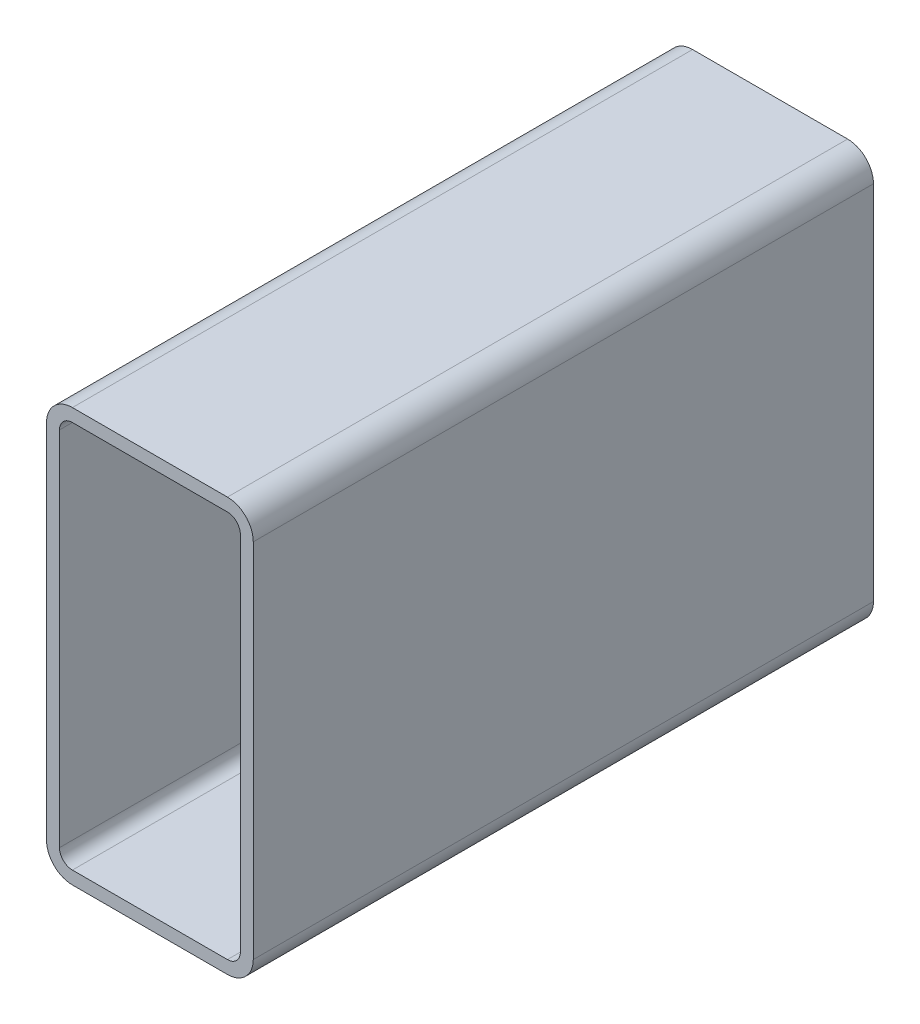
ISO-10303-21;
HEADER;
FILE_DESCRIPTION(('STEP AP214'),'2;1');
FILE_NAME('part.step','',(''),(''),'','','');
FILE_SCHEMA(('AUTOMOTIVE_DESIGN { 1 0 10303 214 1 1 1 1 }'));
ENDSEC;
DATA;
#1=APPLICATION_CONTEXT('core data for automotive mechanical design processes');
#2=APPLICATION_PROTOCOL_DEFINITION('international standard','automotive_design',2000,#1);
#3=PRODUCT_CONTEXT('',#1,'mechanical');
#4=PRODUCT('Part','Part','',(#3));
#5=PRODUCT_RELATED_PRODUCT_CATEGORY('part','',(#4));
#6=PRODUCT_DEFINITION_FORMATION('','',#4);
#7=PRODUCT_DEFINITION_CONTEXT('part definition',#1,'design');
#8=PRODUCT_DEFINITION('design','',#6,#7);
#9=PRODUCT_DEFINITION_SHAPE('','',#8);
#10=(LENGTH_UNIT() NAMED_UNIT(*) SI_UNIT(.MILLI.,.METRE.));
#11=(NAMED_UNIT(*) PLANE_ANGLE_UNIT() SI_UNIT($,.RADIAN.));
#12=(NAMED_UNIT(*) SI_UNIT($,.STERADIAN.) SOLID_ANGLE_UNIT());
#13=UNCERTAINTY_MEASURE_WITH_UNIT(LENGTH_MEASURE(1.E-05),#10,'distance_accuracy_value','');
#14=(GEOMETRIC_REPRESENTATION_CONTEXT(3) GLOBAL_UNCERTAINTY_ASSIGNED_CONTEXT((#13)) GLOBAL_UNIT_ASSIGNED_CONTEXT((#10,
#11,#12)) REPRESENTATION_CONTEXT('',''));
#15=CARTESIAN_POINT('',(0.,0.,0.));
#16=DIRECTION('',(0.,0.,1.));
#17=DIRECTION('',(1.,0.,0.));
#18=AXIS2_PLACEMENT_3D('',#15,#16,#17);
#19=CARTESIAN_POINT('',(14.3751778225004,192.466130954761,304.8));
#20=DIRECTION('',(0.,0.,1.));
#21=DIRECTION('',(1.,0.,0.));
#22=AXIS2_PLACEMENT_3D('',#19,#20,#21);
#23=PLANE('',#22);
#24=CARTESIAN_POINT('',(14.3751778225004,192.466130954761,304.8));
#25=DIRECTION('',(0.,0.,1.));
#26=DIRECTION('',(1.,0.,0.));
#27=AXIS2_PLACEMENT_3D('',#24,#25,#26);
#28=CIRCLE('',#27,12.7);
#29=CARTESIAN_POINT('',(14.3751778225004,205.166130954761,304.8));
#30=VERTEX_POINT('',#29);
#31=CARTESIAN_POINT('',(1.67517782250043,192.466130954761,304.8));
#32=VERTEX_POINT('',#31);
#33=EDGE_CURVE('E211',#30,#32,#28,.T.);
#34=ORIENTED_EDGE('',*,*,#33,.T.);
#35=DIRECTION('',(0.,-1.,0.));
#36=VECTOR('',#35,1.);
#37=CARTESIAN_POINT('',(1.67517782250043,14.6661309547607,304.8));
#38=LINE('',#37,#36);
#39=CARTESIAN_POINT('',(1.67517782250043,14.6661309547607,304.8));
#40=VERTEX_POINT('',#39);
#41=EDGE_CURVE('E214',#32,#40,#38,.T.);
#42=ORIENTED_EDGE('',*,*,#41,.T.);
#43=CARTESIAN_POINT('',(14.3751778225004,14.6661309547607,304.8));
#44=DIRECTION('',(0.,0.,1.));
#45=DIRECTION('',(1.,0.,0.));
#46=AXIS2_PLACEMENT_3D('',#43,#44,#45);
#47=CIRCLE('',#46,12.7);
#48=CARTESIAN_POINT('',(14.3751778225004,1.96613095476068,304.8));
#49=VERTEX_POINT('',#48);
#50=EDGE_CURVE('E217',#40,#49,#47,.T.);
#51=ORIENTED_EDGE('',*,*,#50,.T.);
#52=DIRECTION('',(1.,0.,0.));
#53=VECTOR('',#52,1.);
#54=CARTESIAN_POINT('',(90.5751778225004,1.96613095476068,304.8));
#55=LINE('',#54,#53);
#56=CARTESIAN_POINT('',(90.5751778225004,1.96613095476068,304.8));
#57=VERTEX_POINT('',#56);
#58=EDGE_CURVE('E219',#49,#57,#55,.T.);
#59=ORIENTED_EDGE('',*,*,#58,.T.);
#60=CARTESIAN_POINT('',(90.5751778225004,14.6661309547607,304.8));
#61=DIRECTION('',(0.,0.,1.));
#62=DIRECTION('',(1.,0.,0.));
#63=AXIS2_PLACEMENT_3D('',#60,#61,#62);
#64=CIRCLE('',#63,12.7);
#65=CARTESIAN_POINT('',(103.2751778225,14.6661309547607,304.8));
#66=VERTEX_POINT('',#65);
#67=EDGE_CURVE('E221',#57,#66,#64,.T.);
#68=ORIENTED_EDGE('',*,*,#67,.T.);
#69=DIRECTION('',(0.,1.,0.));
#70=VECTOR('',#69,1.);
#71=CARTESIAN_POINT('',(103.2751778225,192.466130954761,304.8));
#72=LINE('',#71,#70);
#73=CARTESIAN_POINT('',(103.2751778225,192.466130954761,304.8));
#74=VERTEX_POINT('',#73);
#75=EDGE_CURVE('E223',#66,#74,#72,.T.);
#76=ORIENTED_EDGE('',*,*,#75,.T.);
#77=CARTESIAN_POINT('',(90.5751778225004,192.466130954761,304.8));
#78=DIRECTION('',(0.,0.,1.));
#79=DIRECTION('',(1.,0.,0.));
#80=AXIS2_PLACEMENT_3D('',#77,#78,#79);
#81=CIRCLE('',#80,12.7);
#82=CARTESIAN_POINT('',(90.5751778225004,205.166130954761,304.8));
#83=VERTEX_POINT('',#82);
#84=EDGE_CURVE('E225',#74,#83,#81,.T.);
#85=ORIENTED_EDGE('',*,*,#84,.T.);
#86=DIRECTION('',(-1.,0.,0.));
#87=VECTOR('',#86,1.);
#88=CARTESIAN_POINT('',(14.3751778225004,205.166130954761,304.8));
#89=LINE('',#88,#87);
#90=EDGE_CURVE('E227',#83,#30,#89,.T.);
#91=ORIENTED_EDGE('',*,*,#90,.T.);
#92=EDGE_LOOP('',(#34,#42,#51,#59,#68,#76,#85,#91));
#93=FACE_BOUND('',#92,.T.);
#94=DIRECTION('',(0.,-1.,0.));
#95=VECTOR('',#94,1.);
#96=CARTESIAN_POINT('',(8.02517782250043,14.6661309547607,304.8));
#97=LINE('',#96,#95);
#98=CARTESIAN_POINT('',(8.02517782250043,192.466130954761,304.8));
#99=VERTEX_POINT('',#98);
#100=CARTESIAN_POINT('',(8.02517782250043,14.6661309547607,304.8));
#101=VERTEX_POINT('',#100);
#102=EDGE_CURVE('E154',#99,#101,#97,.T.);
#103=ORIENTED_EDGE('',*,*,#102,.F.);
#104=CARTESIAN_POINT('',(14.3751778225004,192.466130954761,304.8));
#105=DIRECTION('',(0.,0.,1.));
#106=DIRECTION('',(1.,0.,0.));
#107=AXIS2_PLACEMENT_3D('',#104,#105,#106);
#108=CIRCLE('',#107,6.35000000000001);
#109=CARTESIAN_POINT('',(14.3751778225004,198.816130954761,304.8));
#110=VERTEX_POINT('',#109);
#111=EDGE_CURVE('E146',#110,#99,#108,.T.);
#112=ORIENTED_EDGE('',*,*,#111,.F.);
#113=DIRECTION('',(-1.,0.,0.));
#114=VECTOR('',#113,1.);
#115=CARTESIAN_POINT('',(14.3751778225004,198.816130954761,304.8));
#116=LINE('',#115,#114);
#117=CARTESIAN_POINT('',(90.5751778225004,198.816130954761,304.8));
#118=VERTEX_POINT('',#117);
#119=EDGE_CURVE('E179',#118,#110,#116,.T.);
#120=ORIENTED_EDGE('',*,*,#119,.F.);
#121=CARTESIAN_POINT('',(90.5751778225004,192.466130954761,304.8));
#122=DIRECTION('',(0.,0.,1.));
#123=DIRECTION('',(1.,0.,0.));
#124=AXIS2_PLACEMENT_3D('',#121,#122,#123);
#125=CIRCLE('',#124,6.35000000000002);
#126=CARTESIAN_POINT('',(96.9251778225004,192.466130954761,304.8));
#127=VERTEX_POINT('',#126);
#128=EDGE_CURVE('E177',#127,#118,#125,.T.);
#129=ORIENTED_EDGE('',*,*,#128,.F.);
#130=DIRECTION('',(0.,1.,0.));
#131=VECTOR('',#130,1.);
#132=CARTESIAN_POINT('',(96.9251778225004,192.466130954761,304.8));
#133=LINE('',#132,#131);
#134=CARTESIAN_POINT('',(96.9251778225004,14.6661309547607,304.8));
#135=VERTEX_POINT('',#134);
#136=EDGE_CURVE('E175',#135,#127,#133,.T.);
#137=ORIENTED_EDGE('',*,*,#136,.F.);
#138=CARTESIAN_POINT('',(90.5751778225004,14.6661309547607,304.8));
#139=DIRECTION('',(0.,0.,1.));
#140=DIRECTION('',(1.,0.,0.));
#141=AXIS2_PLACEMENT_3D('',#138,#139,#140);
#142=CIRCLE('',#141,6.35000000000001);
#143=CARTESIAN_POINT('',(90.5751778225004,8.31613095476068,304.8));
#144=VERTEX_POINT('',#143);
#145=EDGE_CURVE('E173',#144,#135,#142,.T.);
#146=ORIENTED_EDGE('',*,*,#145,.F.);
#147=DIRECTION('',(1.,0.,0.));
#148=VECTOR('',#147,1.);
#149=CARTESIAN_POINT('',(90.5751778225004,8.31613095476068,304.8));
#150=LINE('',#149,#148);
#151=CARTESIAN_POINT('',(14.3751778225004,8.31613095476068,304.8));
#152=VERTEX_POINT('',#151);
#153=EDGE_CURVE('E169',#152,#144,#150,.T.);
#154=ORIENTED_EDGE('',*,*,#153,.F.);
#155=CARTESIAN_POINT('',(14.3751778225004,14.6661309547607,304.8));
#156=DIRECTION('',(0.,0.,1.));
#157=DIRECTION('',(1.,0.,0.));
#158=AXIS2_PLACEMENT_3D('',#155,#156,#157);
#159=CIRCLE('',#158,6.35);
#160=EDGE_CURVE('E167',#101,#152,#159,.T.);
#161=ORIENTED_EDGE('',*,*,#160,.F.);
#162=EDGE_LOOP('',(#103,#112,#120,#129,#137,#146,#154,#161));
#163=FACE_BOUND('',#162,.T.);
#164=ADVANCED_FACE('F33',(#93,#163),#23,.T.);
#165=CARTESIAN_POINT('',(14.3751778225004,192.466130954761,0.));
#166=DIRECTION('',(0.,0.,1.));
#167=DIRECTION('',(1.,0.,0.));
#168=AXIS2_PLACEMENT_3D('',#165,#166,#167);
#169=PLANE('',#168);
#170=CARTESIAN_POINT('',(14.3751778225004,192.466130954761,0.));
#171=DIRECTION('',(0.,0.,1.));
#172=DIRECTION('',(1.,0.,0.));
#173=AXIS2_PLACEMENT_3D('',#170,#171,#172);
#174=CIRCLE('',#173,12.7);
#175=CARTESIAN_POINT('',(14.3751778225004,205.166130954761,0.));
#176=VERTEX_POINT('',#175);
#177=CARTESIAN_POINT('',(1.67517782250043,192.466130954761,0.));
#178=VERTEX_POINT('',#177);
#179=EDGE_CURVE('E162',#176,#178,#174,.T.);
#180=ORIENTED_EDGE('',*,*,#179,.F.);
#181=DIRECTION('',(-1.,0.,0.));
#182=VECTOR('',#181,1.);
#183=CARTESIAN_POINT('',(14.3751778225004,205.166130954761,0.));
#184=LINE('',#183,#182);
#185=CARTESIAN_POINT('',(90.5751778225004,205.166130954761,0.));
#186=VERTEX_POINT('',#185);
#187=EDGE_CURVE('E215',#186,#176,#184,.T.);
#188=ORIENTED_EDGE('',*,*,#187,.F.);
#189=CARTESIAN_POINT('',(90.5751778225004,192.466130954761,0.));
#190=DIRECTION('',(0.,0.,1.));
#191=DIRECTION('',(1.,0.,0.));
#192=AXIS2_PLACEMENT_3D('',#189,#190,#191);
#193=CIRCLE('',#192,12.7);
#194=CARTESIAN_POINT('',(103.2751778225,192.466130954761,0.));
#195=VERTEX_POINT('',#194);
#196=EDGE_CURVE('E242',#195,#186,#193,.T.);
#197=ORIENTED_EDGE('',*,*,#196,.F.);
#198=DIRECTION('',(0.,1.,0.));
#199=VECTOR('',#198,1.);
#200=CARTESIAN_POINT('',(103.2751778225,192.466130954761,0.));
#201=LINE('',#200,#199);
#202=CARTESIAN_POINT('',(103.2751778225,14.6661309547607,0.));
#203=VERTEX_POINT('',#202);
#204=EDGE_CURVE('E240',#203,#195,#201,.T.);
#205=ORIENTED_EDGE('',*,*,#204,.F.);
#206=CARTESIAN_POINT('',(90.5751778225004,14.6661309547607,0.));
#207=DIRECTION('',(0.,0.,1.));
#208=DIRECTION('',(1.,0.,0.));
#209=AXIS2_PLACEMENT_3D('',#206,#207,#208);
#210=CIRCLE('',#209,12.7);
#211=CARTESIAN_POINT('',(90.5751778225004,1.96613095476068,0.));
#212=VERTEX_POINT('',#211);
#213=EDGE_CURVE('E238',#212,#203,#210,.T.);
#214=ORIENTED_EDGE('',*,*,#213,.F.);
#215=DIRECTION('',(1.,0.,0.));
#216=VECTOR('',#215,1.);
#217=CARTESIAN_POINT('',(90.5751778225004,1.96613095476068,0.));
#218=LINE('',#217,#216);
#219=CARTESIAN_POINT('',(14.3751778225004,1.96613095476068,0.));
#220=VERTEX_POINT('',#219);
#221=EDGE_CURVE('E236',#220,#212,#218,.T.);
#222=ORIENTED_EDGE('',*,*,#221,.F.);
#223=CARTESIAN_POINT('',(14.3751778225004,14.6661309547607,0.));
#224=DIRECTION('',(0.,0.,1.));
#225=DIRECTION('',(1.,0.,0.));
#226=AXIS2_PLACEMENT_3D('',#223,#224,#225);
#227=CIRCLE('',#226,12.7);
#228=CARTESIAN_POINT('',(1.67517782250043,14.6661309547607,0.));
#229=VERTEX_POINT('',#228);
#230=EDGE_CURVE('E234',#229,#220,#227,.T.);
#231=ORIENTED_EDGE('',*,*,#230,.F.);
#232=DIRECTION('',(0.,-1.,0.));
#233=VECTOR('',#232,1.);
#234=CARTESIAN_POINT('',(1.67517782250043,14.6661309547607,0.));
#235=LINE('',#234,#233);
#236=EDGE_CURVE('E232',#178,#229,#235,.T.);
#237=ORIENTED_EDGE('',*,*,#236,.F.);
#238=EDGE_LOOP('',(#180,#188,#197,#205,#214,#222,#231,#237));
#239=FACE_BOUND('',#238,.T.);
#240=CARTESIAN_POINT('',(14.3751778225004,192.466130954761,0.));
#241=DIRECTION('',(0.,0.,1.));
#242=DIRECTION('',(1.,0.,0.));
#243=AXIS2_PLACEMENT_3D('',#240,#241,#242);
#244=CIRCLE('',#243,6.35000000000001);
#245=CARTESIAN_POINT('',(14.3751778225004,198.816130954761,0.));
#246=VERTEX_POINT('',#245);
#247=CARTESIAN_POINT('',(8.02517782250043,192.466130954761,0.));
#248=VERTEX_POINT('',#247);
#249=EDGE_CURVE('E56',#246,#248,#244,.T.);
#250=ORIENTED_EDGE('',*,*,#249,.T.);
#251=DIRECTION('',(0.,-1.,0.));
#252=VECTOR('',#251,1.);
#253=CARTESIAN_POINT('',(8.02517782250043,14.6661309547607,0.));
#254=LINE('',#253,#252);
#255=CARTESIAN_POINT('',(8.02517782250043,14.6661309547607,0.));
#256=VERTEX_POINT('',#255);
#257=EDGE_CURVE('E161',#248,#256,#254,.T.);
#258=ORIENTED_EDGE('',*,*,#257,.T.);
#259=CARTESIAN_POINT('',(14.3751778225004,14.6661309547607,0.));
#260=DIRECTION('',(0.,0.,1.));
#261=DIRECTION('',(1.,0.,0.));
#262=AXIS2_PLACEMENT_3D('',#259,#260,#261);
#263=CIRCLE('',#262,6.35);
#264=CARTESIAN_POINT('',(14.3751778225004,8.31613095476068,0.));
#265=VERTEX_POINT('',#264);
#266=EDGE_CURVE('E183',#256,#265,#263,.T.);
#267=ORIENTED_EDGE('',*,*,#266,.T.);
#268=DIRECTION('',(1.,0.,0.));
#269=VECTOR('',#268,1.);
#270=CARTESIAN_POINT('',(90.5751778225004,8.31613095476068,0.));
#271=LINE('',#270,#269);
#272=CARTESIAN_POINT('',(90.5751778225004,8.31613095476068,0.));
#273=VERTEX_POINT('',#272);
#274=EDGE_CURVE('E186',#265,#273,#271,.T.);
#275=ORIENTED_EDGE('',*,*,#274,.T.);
#276=CARTESIAN_POINT('',(90.5751778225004,14.6661309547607,0.));
#277=DIRECTION('',(0.,0.,1.));
#278=DIRECTION('',(1.,0.,0.));
#279=AXIS2_PLACEMENT_3D('',#276,#277,#278);
#280=CIRCLE('',#279,6.35000000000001);
#281=CARTESIAN_POINT('',(96.9251778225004,14.6661309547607,0.));
#282=VERTEX_POINT('',#281);
#283=EDGE_CURVE('E189',#273,#282,#280,.T.);
#284=ORIENTED_EDGE('',*,*,#283,.T.);
#285=DIRECTION('',(0.,1.,0.));
#286=VECTOR('',#285,1.);
#287=CARTESIAN_POINT('',(96.9251778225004,192.466130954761,0.));
#288=LINE('',#287,#286);
#289=CARTESIAN_POINT('',(96.9251778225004,192.466130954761,0.));
#290=VERTEX_POINT('',#289);
#291=EDGE_CURVE('E192',#282,#290,#288,.T.);
#292=ORIENTED_EDGE('',*,*,#291,.T.);
#293=CARTESIAN_POINT('',(90.5751778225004,192.466130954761,0.));
#294=DIRECTION('',(0.,0.,1.));
#295=DIRECTION('',(1.,0.,0.));
#296=AXIS2_PLACEMENT_3D('',#293,#294,#295);
#297=CIRCLE('',#296,6.35000000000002);
#298=CARTESIAN_POINT('',(90.5751778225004,198.816130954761,0.));
#299=VERTEX_POINT('',#298);
#300=EDGE_CURVE('E195',#290,#299,#297,.T.);
#301=ORIENTED_EDGE('',*,*,#300,.T.);
#302=DIRECTION('',(-1.,0.,0.));
#303=VECTOR('',#302,1.);
#304=CARTESIAN_POINT('',(14.3751778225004,198.816130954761,0.));
#305=LINE('',#304,#303);
#306=EDGE_CURVE('E155',#299,#246,#305,.T.);
#307=ORIENTED_EDGE('',*,*,#306,.T.);
#308=EDGE_LOOP('',(#250,#258,#267,#275,#284,#292,#301,#307));
#309=FACE_BOUND('',#308,.T.);
#310=ADVANCED_FACE('F272',(#239,#309),#169,.F.);
#311=CARTESIAN_POINT('',(14.3751778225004,192.466130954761,304.8));
#312=DIRECTION('',(0.,0.,-1.));
#313=DIRECTION('',(-1.,0.,0.));
#314=AXIS2_PLACEMENT_3D('',#311,#312,#313);
#315=CYLINDRICAL_SURFACE('',#314,12.7);
#316=ORIENTED_EDGE('',*,*,#179,.T.);
#317=DIRECTION('',(0.,0.,-1.));
#318=VECTOR('',#317,1.);
#319=CARTESIAN_POINT('',(1.67517782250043,192.466130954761,304.8));
#320=LINE('',#319,#318);
#321=EDGE_CURVE('E11',#32,#178,#320,.T.);
#322=ORIENTED_EDGE('',*,*,#321,.F.);
#323=ORIENTED_EDGE('',*,*,#33,.F.);
#324=DIRECTION('',(0.,0.,-1.));
#325=VECTOR('',#324,1.);
#326=CARTESIAN_POINT('',(14.3751778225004,205.166130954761,304.8));
#327=LINE('',#326,#325);
#328=EDGE_CURVE('E229',#30,#176,#327,.T.);
#329=ORIENTED_EDGE('',*,*,#328,.T.);
#330=EDGE_LOOP('',(#316,#322,#323,#329));
#331=FACE_BOUND('',#330,.T.);
#332=ADVANCED_FACE('F35',(#331),#315,.T.);
#333=CARTESIAN_POINT('',(1.67517782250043,14.6661309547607,304.8));
#334=DIRECTION('',(1.,0.,0.));
#335=DIRECTION('',(0.,0.,-1.));
#336=AXIS2_PLACEMENT_3D('',#333,#334,#335);
#337=PLANE('',#336);
#338=ORIENTED_EDGE('',*,*,#236,.T.);
#339=DIRECTION('',(0.,0.,-1.));
#340=VECTOR('',#339,1.);
#341=CARTESIAN_POINT('',(1.67517782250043,14.6661309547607,304.8));
#342=LINE('',#341,#340);
#343=EDGE_CURVE('E41',#40,#229,#342,.T.);
#344=ORIENTED_EDGE('',*,*,#343,.F.);
#345=ORIENTED_EDGE('',*,*,#41,.F.);
#346=ORIENTED_EDGE('',*,*,#321,.T.);
#347=EDGE_LOOP('',(#338,#344,#345,#346));
#348=FACE_BOUND('',#347,.T.);
#349=ADVANCED_FACE('F289',(#348),#337,.F.);
#350=CARTESIAN_POINT('',(14.3751778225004,14.6661309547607,304.8));
#351=DIRECTION('',(0.,0.,-1.));
#352=DIRECTION('',(-1.,0.,0.));
#353=AXIS2_PLACEMENT_3D('',#350,#351,#352);
#354=CYLINDRICAL_SURFACE('',#353,12.7);
#355=ORIENTED_EDGE('',*,*,#230,.T.);
#356=DIRECTION('',(0.,0.,-1.));
#357=VECTOR('',#356,1.);
#358=CARTESIAN_POINT('',(14.3751778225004,1.96613095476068,304.8));
#359=LINE('',#358,#357);
#360=EDGE_CURVE('E259',#49,#220,#359,.T.);
#361=ORIENTED_EDGE('',*,*,#360,.F.);
#362=ORIENTED_EDGE('',*,*,#50,.F.);
#363=ORIENTED_EDGE('',*,*,#343,.T.);
#364=EDGE_LOOP('',(#355,#361,#362,#363));
#365=FACE_BOUND('',#364,.T.);
#366=ADVANCED_FACE('F266',(#365),#354,.T.);
#367=CARTESIAN_POINT('',(90.5751778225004,1.96613095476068,304.8));
#368=DIRECTION('',(0.,1.,0.));
#369=DIRECTION('',(0.,0.,1.));
#370=AXIS2_PLACEMENT_3D('',#367,#368,#369);
#371=PLANE('',#370);
#372=ORIENTED_EDGE('',*,*,#221,.T.);
#373=DIRECTION('',(0.,0.,-1.));
#374=VECTOR('',#373,1.);
#375=CARTESIAN_POINT('',(90.5751778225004,1.96613095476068,304.8));
#376=LINE('',#375,#374);
#377=EDGE_CURVE('E256',#57,#212,#376,.T.);
#378=ORIENTED_EDGE('',*,*,#377,.F.);
#379=ORIENTED_EDGE('',*,*,#58,.F.);
#380=ORIENTED_EDGE('',*,*,#360,.T.);
#381=EDGE_LOOP('',(#372,#378,#379,#380));
#382=FACE_BOUND('',#381,.T.);
#383=ADVANCED_FACE('F278',(#382),#371,.F.);
#384=CARTESIAN_POINT('',(90.5751778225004,14.6661309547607,304.8));
#385=DIRECTION('',(0.,0.,-1.));
#386=DIRECTION('',(-1.,0.,0.));
#387=AXIS2_PLACEMENT_3D('',#384,#385,#386);
#388=CYLINDRICAL_SURFACE('',#387,12.7);
#389=ORIENTED_EDGE('',*,*,#213,.T.);
#390=DIRECTION('',(0.,0.,-1.));
#391=VECTOR('',#390,1.);
#392=CARTESIAN_POINT('',(103.2751778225,14.6661309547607,304.8));
#393=LINE('',#392,#391);
#394=EDGE_CURVE('E253',#66,#203,#393,.T.);
#395=ORIENTED_EDGE('',*,*,#394,.F.);
#396=ORIENTED_EDGE('',*,*,#67,.F.);
#397=ORIENTED_EDGE('',*,*,#377,.T.);
#398=EDGE_LOOP('',(#389,#395,#396,#397));
#399=FACE_BOUND('',#398,.T.);
#400=ADVANCED_FACE('F282',(#399),#388,.T.);
#401=CARTESIAN_POINT('',(103.2751778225,192.466130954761,304.8));
#402=DIRECTION('',(-1.,0.,0.));
#403=DIRECTION('',(0.,0.,1.));
#404=AXIS2_PLACEMENT_3D('',#401,#402,#403);
#405=PLANE('',#404);
#406=ORIENTED_EDGE('',*,*,#204,.T.);
#407=DIRECTION('',(0.,0.,-1.));
#408=VECTOR('',#407,1.);
#409=CARTESIAN_POINT('',(103.2751778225,192.466130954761,304.8));
#410=LINE('',#409,#408);
#411=EDGE_CURVE('E250',#74,#195,#410,.T.);
#412=ORIENTED_EDGE('',*,*,#411,.F.);
#413=ORIENTED_EDGE('',*,*,#75,.F.);
#414=ORIENTED_EDGE('',*,*,#394,.T.);
#415=EDGE_LOOP('',(#406,#412,#413,#414));
#416=FACE_BOUND('',#415,.T.);
#417=ADVANCED_FACE('F302',(#416),#405,.F.);
#418=CARTESIAN_POINT('',(90.5751778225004,192.466130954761,304.8));
#419=DIRECTION('',(0.,0.,-1.));
#420=DIRECTION('',(-1.,0.,0.));
#421=AXIS2_PLACEMENT_3D('',#418,#419,#420);
#422=CYLINDRICAL_SURFACE('',#421,12.7);
#423=ORIENTED_EDGE('',*,*,#196,.T.);
#424=DIRECTION('',(0.,0.,-1.));
#425=VECTOR('',#424,1.);
#426=CARTESIAN_POINT('',(90.5751778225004,205.166130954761,304.8));
#427=LINE('',#426,#425);
#428=EDGE_CURVE('E247',#83,#186,#427,.T.);
#429=ORIENTED_EDGE('',*,*,#428,.F.);
#430=ORIENTED_EDGE('',*,*,#84,.F.);
#431=ORIENTED_EDGE('',*,*,#411,.T.);
#432=EDGE_LOOP('',(#423,#429,#430,#431));
#433=FACE_BOUND('',#432,.T.);
#434=ADVANCED_FACE('F300',(#433),#422,.T.);
#435=CARTESIAN_POINT('',(14.3751778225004,205.166130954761,304.8));
#436=DIRECTION('',(0.,-1.,0.));
#437=DIRECTION('',(0.,0.,-1.));
#438=AXIS2_PLACEMENT_3D('',#435,#436,#437);
#439=PLANE('',#438);
#440=ORIENTED_EDGE('',*,*,#187,.T.);
#441=ORIENTED_EDGE('',*,*,#328,.F.);
#442=ORIENTED_EDGE('',*,*,#90,.F.);
#443=ORIENTED_EDGE('',*,*,#428,.T.);
#444=EDGE_LOOP('',(#440,#441,#442,#443));
#445=FACE_BOUND('',#444,.T.);
#446=ADVANCED_FACE('F295',(#445),#439,.F.);
#447=CARTESIAN_POINT('',(14.3751778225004,192.466130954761,304.8));
#448=DIRECTION('',(0.,0.,-1.));
#449=DIRECTION('',(-1.,0.,0.));
#450=AXIS2_PLACEMENT_3D('',#447,#448,#449);
#451=CYLINDRICAL_SURFACE('',#450,6.35000000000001);
#452=ORIENTED_EDGE('',*,*,#249,.F.);
#453=DIRECTION('',(0.,0.,-1.));
#454=VECTOR('',#453,1.);
#455=CARTESIAN_POINT('',(14.3751778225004,198.816130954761,304.8));
#456=LINE('',#455,#454);
#457=EDGE_CURVE('E150',#110,#246,#456,.T.);
#458=ORIENTED_EDGE('',*,*,#457,.F.);
#459=ORIENTED_EDGE('',*,*,#111,.T.);
#460=DIRECTION('',(0.,0.,-1.));
#461=VECTOR('',#460,1.);
#462=CARTESIAN_POINT('',(8.02517782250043,192.466130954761,304.8));
#463=LINE('',#462,#461);
#464=EDGE_CURVE('E149',#99,#248,#463,.T.);
#465=ORIENTED_EDGE('',*,*,#464,.T.);
#466=EDGE_LOOP('',(#452,#458,#459,#465));
#467=FACE_BOUND('',#466,.T.);
#468=ADVANCED_FACE('F148',(#467),#451,.F.);
#469=CARTESIAN_POINT('',(8.02517782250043,14.6661309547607,304.8));
#470=DIRECTION('',(1.,0.,0.));
#471=DIRECTION('',(0.,0.,-1.));
#472=AXIS2_PLACEMENT_3D('',#469,#470,#471);
#473=PLANE('',#472);
#474=ORIENTED_EDGE('',*,*,#257,.F.);
#475=ORIENTED_EDGE('',*,*,#464,.F.);
#476=ORIENTED_EDGE('',*,*,#102,.T.);
#477=DIRECTION('',(0.,0.,-1.));
#478=VECTOR('',#477,1.);
#479=CARTESIAN_POINT('',(8.02517782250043,14.6661309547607,304.8));
#480=LINE('',#479,#478);
#481=EDGE_CURVE('E163',#101,#256,#480,.T.);
#482=ORIENTED_EDGE('',*,*,#481,.T.);
#483=EDGE_LOOP('',(#474,#475,#476,#482));
#484=FACE_BOUND('',#483,.T.);
#485=ADVANCED_FACE('F158',(#484),#473,.T.);
#486=CARTESIAN_POINT('',(14.3751778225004,14.6661309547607,304.8));
#487=DIRECTION('',(0.,0.,-1.));
#488=DIRECTION('',(-1.,0.,0.));
#489=AXIS2_PLACEMENT_3D('',#486,#487,#488);
#490=CYLINDRICAL_SURFACE('',#489,6.35);
#491=ORIENTED_EDGE('',*,*,#266,.F.);
#492=ORIENTED_EDGE('',*,*,#481,.F.);
#493=ORIENTED_EDGE('',*,*,#160,.T.);
#494=DIRECTION('',(0.,0.,-1.));
#495=VECTOR('',#494,1.);
#496=CARTESIAN_POINT('',(14.3751778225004,8.31613095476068,304.8));
#497=LINE('',#496,#495);
#498=EDGE_CURVE('E208',#152,#265,#497,.T.);
#499=ORIENTED_EDGE('',*,*,#498,.T.);
#500=EDGE_LOOP('',(#491,#492,#493,#499));
#501=FACE_BOUND('',#500,.T.);
#502=ADVANCED_FACE('F327',(#501),#490,.F.);
#503=CARTESIAN_POINT('',(90.5751778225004,8.31613095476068,304.8));
#504=DIRECTION('',(0.,1.,0.));
#505=DIRECTION('',(0.,0.,1.));
#506=AXIS2_PLACEMENT_3D('',#503,#504,#505);
#507=PLANE('',#506);
#508=ORIENTED_EDGE('',*,*,#274,.F.);
#509=ORIENTED_EDGE('',*,*,#498,.F.);
#510=ORIENTED_EDGE('',*,*,#153,.T.);
#511=DIRECTION('',(0.,0.,-1.));
#512=VECTOR('',#511,1.);
#513=CARTESIAN_POINT('',(90.5751778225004,8.31613095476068,304.8));
#514=LINE('',#513,#512);
#515=EDGE_CURVE('E206',#144,#273,#514,.T.);
#516=ORIENTED_EDGE('',*,*,#515,.T.);
#517=EDGE_LOOP('',(#508,#509,#510,#516));
#518=FACE_BOUND('',#517,.T.);
#519=ADVANCED_FACE('F331',(#518),#507,.T.);
#520=CARTESIAN_POINT('',(90.5751778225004,14.6661309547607,304.8));
#521=DIRECTION('',(0.,0.,-1.));
#522=DIRECTION('',(-1.,0.,0.));
#523=AXIS2_PLACEMENT_3D('',#520,#521,#522);
#524=CYLINDRICAL_SURFACE('',#523,6.35000000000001);
#525=ORIENTED_EDGE('',*,*,#283,.F.);
#526=ORIENTED_EDGE('',*,*,#515,.F.);
#527=ORIENTED_EDGE('',*,*,#145,.T.);
#528=DIRECTION('',(0.,0.,-1.));
#529=VECTOR('',#528,1.);
#530=CARTESIAN_POINT('',(96.9251778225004,14.6661309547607,304.8));
#531=LINE('',#530,#529);
#532=EDGE_CURVE('E204',#135,#282,#531,.T.);
#533=ORIENTED_EDGE('',*,*,#532,.T.);
#534=EDGE_LOOP('',(#525,#526,#527,#533));
#535=FACE_BOUND('',#534,.T.);
#536=ADVANCED_FACE('F337',(#535),#524,.F.);
#537=CARTESIAN_POINT('',(96.9251778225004,192.466130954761,304.8));
#538=DIRECTION('',(-1.,0.,0.));
#539=DIRECTION('',(0.,0.,1.));
#540=AXIS2_PLACEMENT_3D('',#537,#538,#539);
#541=PLANE('',#540);
#542=ORIENTED_EDGE('',*,*,#291,.F.);
#543=ORIENTED_EDGE('',*,*,#532,.F.);
#544=ORIENTED_EDGE('',*,*,#136,.T.);
#545=DIRECTION('',(0.,0.,-1.));
#546=VECTOR('',#545,1.);
#547=CARTESIAN_POINT('',(96.9251778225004,192.466130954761,304.8));
#548=LINE('',#547,#546);
#549=EDGE_CURVE('E202',#127,#290,#548,.T.);
#550=ORIENTED_EDGE('',*,*,#549,.T.);
#551=EDGE_LOOP('',(#542,#543,#544,#550));
#552=FACE_BOUND('',#551,.T.);
#553=ADVANCED_FACE('F341',(#552),#541,.T.);
#554=CARTESIAN_POINT('',(90.5751778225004,192.466130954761,304.8));
#555=DIRECTION('',(0.,0.,-1.));
#556=DIRECTION('',(-1.,0.,0.));
#557=AXIS2_PLACEMENT_3D('',#554,#555,#556);
#558=CYLINDRICAL_SURFACE('',#557,6.35000000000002);
#559=ORIENTED_EDGE('',*,*,#300,.F.);
#560=ORIENTED_EDGE('',*,*,#549,.F.);
#561=ORIENTED_EDGE('',*,*,#128,.T.);
#562=DIRECTION('',(0.,0.,-1.));
#563=VECTOR('',#562,1.);
#564=CARTESIAN_POINT('',(90.5751778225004,198.816130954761,304.8));
#565=LINE('',#564,#563);
#566=EDGE_CURVE('E48',#118,#299,#565,.T.);
#567=ORIENTED_EDGE('',*,*,#566,.T.);
#568=EDGE_LOOP('',(#559,#560,#561,#567));
#569=FACE_BOUND('',#568,.T.);
#570=ADVANCED_FACE('F345',(#569),#558,.F.);
#571=CARTESIAN_POINT('',(14.3751778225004,198.816130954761,304.8));
#572=DIRECTION('',(0.,-1.,0.));
#573=DIRECTION('',(0.,0.,-1.));
#574=AXIS2_PLACEMENT_3D('',#571,#572,#573);
#575=PLANE('',#574);
#576=ORIENTED_EDGE('',*,*,#306,.F.);
#577=ORIENTED_EDGE('',*,*,#566,.F.);
#578=ORIENTED_EDGE('',*,*,#119,.T.);
#579=ORIENTED_EDGE('',*,*,#457,.T.);
#580=EDGE_LOOP('',(#576,#577,#578,#579));
#581=FACE_BOUND('',#580,.T.);
#582=ADVANCED_FACE('F349',(#581),#575,.T.);
#583=CLOSED_SHELL('',(#164,#310,#332,#349,#366,#383,#400,#417,#434,#446,#468,#485,#502,#519,
#536,#553,#570,#582));
#584=MANIFOLD_SOLID_BREP('B2',#583);
#585=ADVANCED_BREP_SHAPE_REPRESENTATION('',(#18,#584),#14);
#586=SHAPE_DEFINITION_REPRESENTATION(#9,#585);
ENDSEC;
END-ISO-10303-21;
